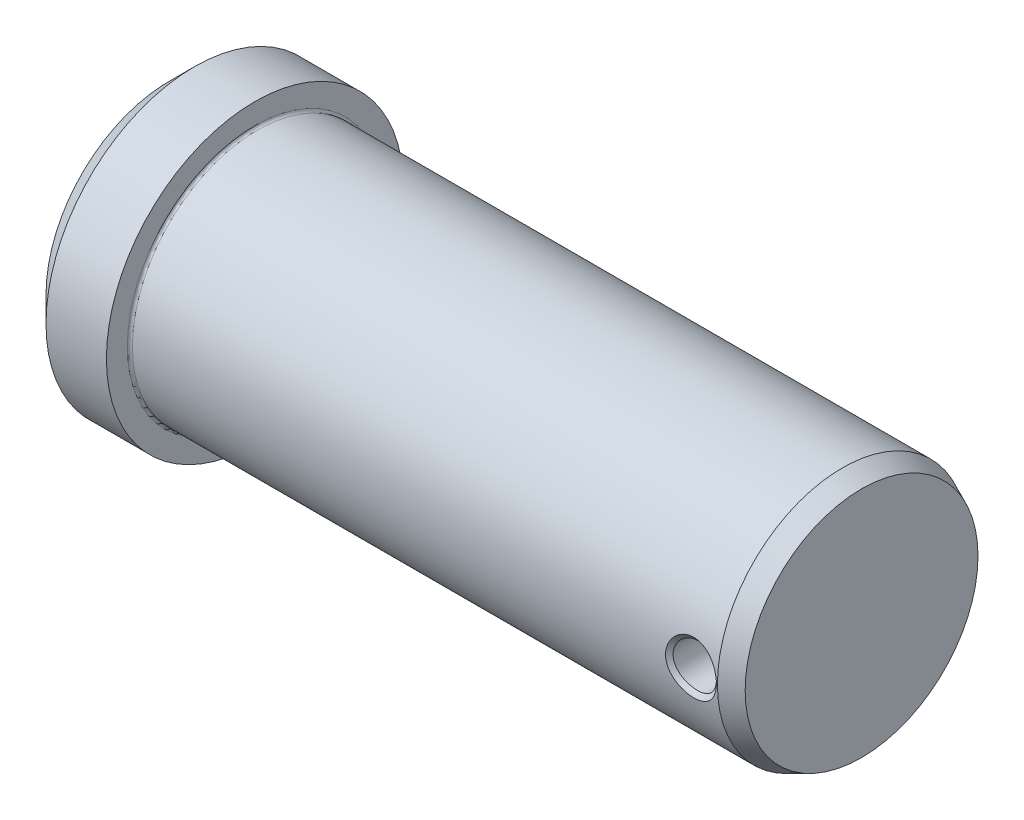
ISO-10303-21;
HEADER;
FILE_DESCRIPTION(('STEP AP214'),'2;1');
FILE_NAME('part.step','',(''),(''),'','','');
FILE_SCHEMA(('AUTOMOTIVE_DESIGN { 1 0 10303 214 1 1 1 1 }'));
ENDSEC;
DATA;
#1=APPLICATION_CONTEXT('core data for automotive mechanical design processes');
#2=APPLICATION_PROTOCOL_DEFINITION('international standard','automotive_design',2000,#1);
#3=PRODUCT_CONTEXT('',#1,'mechanical');
#4=PRODUCT('Part','Part','',(#3));
#5=PRODUCT_RELATED_PRODUCT_CATEGORY('part','',(#4));
#6=PRODUCT_DEFINITION_FORMATION('','',#4);
#7=PRODUCT_DEFINITION_CONTEXT('part definition',#1,'design');
#8=PRODUCT_DEFINITION('design','',#6,#7);
#9=PRODUCT_DEFINITION_SHAPE('','',#8);
#10=(LENGTH_UNIT() NAMED_UNIT(*) SI_UNIT(.MILLI.,.METRE.));
#11=(NAMED_UNIT(*) PLANE_ANGLE_UNIT() SI_UNIT($,.RADIAN.));
#12=(NAMED_UNIT(*) SI_UNIT($,.STERADIAN.) SOLID_ANGLE_UNIT());
#13=UNCERTAINTY_MEASURE_WITH_UNIT(LENGTH_MEASURE(1.E-05),#10,'distance_accuracy_value','');
#14=(GEOMETRIC_REPRESENTATION_CONTEXT(3) GLOBAL_UNCERTAINTY_ASSIGNED_CONTEXT((#13)) GLOBAL_UNIT_ASSIGNED_CONTEXT((#10,
#11,#12)) REPRESENTATION_CONTEXT('',''));
#15=CARTESIAN_POINT('',(0.,0.,0.));
#16=DIRECTION('',(0.,0.,1.));
#17=DIRECTION('',(1.,0.,0.));
#18=AXIS2_PLACEMENT_3D('',#15,#16,#17);
#19=CARTESIAN_POINT('',(0.,0.,0.));
#20=DIRECTION('',(-1.,0.,0.));
#21=DIRECTION('',(0.,0.,1.));
#22=AXIS2_PLACEMENT_3D('',#19,#20,#21);
#23=PLANE('',#22);
#24=CARTESIAN_POINT('',(0.,0.,0.));
#25=DIRECTION('',(-1.,0.,0.));
#26=DIRECTION('',(0.,0.,1.));
#27=AXIS2_PLACEMENT_3D('',#24,#25,#26);
#28=CIRCLE('',#27,12.446);
#29=CARTESIAN_POINT('',(0.,0.,12.446));
#30=VERTEX_POINT('',#29);
#31=EDGE_CURVE('E64',#30,#30,#28,.T.);
#32=ORIENTED_EDGE('',*,*,#31,.T.);
#33=EDGE_LOOP('',(#32));
#34=FACE_BOUND('',#33,.T.);
#35=ADVANCED_FACE('F37',(#34),#23,.T.);
#36=CARTESIAN_POINT('',(0.,0.,0.));
#37=DIRECTION('',(1.,0.,0.));
#38=DIRECTION('',(0.,0.,-1.));
#39=AXIS2_PLACEMENT_3D('',#36,#37,#38);
#40=CONICAL_SURFACE('',#39,12.446,0.785398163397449);
#41=CARTESIAN_POINT('',(2.54,0.,0.));
#42=DIRECTION('',(-1.,0.,0.));
#43=DIRECTION('',(0.,0.,1.));
#44=AXIS2_PLACEMENT_3D('',#41,#42,#43);
#45=CIRCLE('',#44,14.986);
#46=CARTESIAN_POINT('',(2.54,0.,14.986));
#47=VERTEX_POINT('',#46);
#48=EDGE_CURVE('E69',#47,#47,#45,.T.);
#49=ORIENTED_EDGE('',*,*,#48,.T.);
#50=EDGE_LOOP('',(#49));
#51=FACE_BOUND('',#50,.T.);
#52=ORIENTED_EDGE('',*,*,#31,.F.);
#53=EDGE_LOOP('',(#52));
#54=FACE_BOUND('',#53,.T.);
#55=ADVANCED_FACE('F162',(#51,#54),#40,.T.);
#56=CARTESIAN_POINT('',(0.,0.,0.));
#57=DIRECTION('',(-1.,0.,0.));
#58=DIRECTION('',(0.,0.,1.));
#59=AXIS2_PLACEMENT_3D('',#56,#57,#58);
#60=CYLINDRICAL_SURFACE('',#59,14.986);
#61=CARTESIAN_POINT('',(8.636,0.,0.));
#62=DIRECTION('',(-1.,0.,0.));
#63=DIRECTION('',(0.,0.,1.));
#64=AXIS2_PLACEMENT_3D('',#61,#62,#63);
#65=CIRCLE('',#64,14.986);
#66=CARTESIAN_POINT('',(8.636,0.,14.986));
#67=VERTEX_POINT('',#66);
#68=EDGE_CURVE('E74',#67,#67,#65,.T.);
#69=ORIENTED_EDGE('',*,*,#68,.T.);
#70=EDGE_LOOP('',(#69));
#71=FACE_BOUND('',#70,.T.);
#72=ORIENTED_EDGE('',*,*,#48,.F.);
#73=EDGE_LOOP('',(#72));
#74=FACE_BOUND('',#73,.T.);
#75=ADVANCED_FACE('F165',(#71,#74),#60,.T.);
#76=CARTESIAN_POINT('',(8.636,14.986,0.));
#77=DIRECTION('',(1.,0.,0.));
#78=DIRECTION('',(0.,0.,-1.));
#79=AXIS2_PLACEMENT_3D('',#76,#77,#78);
#80=PLANE('',#79);
#81=CARTESIAN_POINT('',(8.636,0.,0.));
#82=DIRECTION('',(-1.,0.,0.));
#83=DIRECTION('',(0.,0.,1.));
#84=AXIS2_PLACEMENT_3D('',#81,#82,#83);
#85=CIRCLE('',#84,12.87145);
#86=CARTESIAN_POINT('',(8.636,0.,12.87145));
#87=VERTEX_POINT('',#86);
#88=EDGE_CURVE('E179',#87,#87,#85,.T.);
#89=ORIENTED_EDGE('',*,*,#88,.T.);
#90=EDGE_LOOP('',(#89));
#91=FACE_BOUND('',#90,.T.);
#92=ORIENTED_EDGE('',*,*,#68,.F.);
#93=EDGE_LOOP('',(#92));
#94=FACE_BOUND('',#93,.T.);
#95=ADVANCED_FACE('F168',(#91,#94),#80,.T.);
#96=CARTESIAN_POINT('',(8.89,0.,0.));
#97=DIRECTION('',(-1.,0.,0.));
#98=DIRECTION('',(0.,0.,1.));
#99=AXIS2_PLACEMENT_3D('',#96,#97,#98);
#100=TOROIDAL_SURFACE('',#99,12.87145,0.254000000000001);
#101=ORIENTED_EDGE('',*,*,#88,.F.);
#102=EDGE_LOOP('',(#101));
#103=FACE_BOUND('',#102,.T.);
#104=CARTESIAN_POINT('',(8.89,0.,0.));
#105=DIRECTION('',(-1.,0.,0.));
#106=DIRECTION('',(0.,0.,1.));
#107=AXIS2_PLACEMENT_3D('',#104,#105,#106);
#108=CIRCLE('',#107,12.61745);
#109=CARTESIAN_POINT('',(8.89,0.,12.61745));
#110=VERTEX_POINT('',#109);
#111=EDGE_CURVE('E182',#110,#110,#108,.T.);
#112=ORIENTED_EDGE('',*,*,#111,.T.);
#113=EDGE_LOOP('',(#112));
#114=FACE_BOUND('',#113,.T.);
#115=ADVANCED_FACE('F120',(#103,#114),#100,.F.);
#116=CARTESIAN_POINT('',(0.,0.,0.));
#117=DIRECTION('',(-1.,0.,0.));
#118=DIRECTION('',(0.,0.,1.));
#119=AXIS2_PLACEMENT_3D('',#116,#117,#118);
#120=CYLINDRICAL_SURFACE('',#119,12.61745);
#121=CARTESIAN_POINT('',(67.8179999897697,0.,12.61745));
#122=CARTESIAN_POINT('',(67.8178069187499,0.696221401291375,12.6174155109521));
#123=CARTESIAN_POINT('',(67.5397729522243,1.3818841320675,12.5526092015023));
#124=CARTESIAN_POINT('',(66.5931709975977,2.35939139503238,12.403412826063));
#125=CARTESIAN_POINT('',(65.9281515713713,2.64550020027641,12.337009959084));
#126=CARTESIAN_POINT('',(64.5791761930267,2.64505437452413,12.3370697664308));
#127=CARTESIAN_POINT('',(63.9138142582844,2.36021994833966,12.4032851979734));
#128=CARTESIAN_POINT('',(62.9650043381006,1.38245980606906,12.5525262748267));
#129=CARTESIAN_POINT('',(62.687329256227,0.698953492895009,12.6174319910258));
#130=CARTESIAN_POINT('',(62.687070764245,-0.698964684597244,12.6174680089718));
#131=CARTESIAN_POINT('',(62.9644356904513,-1.38174711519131,12.5526236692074));
#132=CARTESIAN_POINT('',(63.9131331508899,-2.35964469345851,12.4033809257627));
#133=CARTESIAN_POINT('',(64.5793583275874,-2.64515652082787,12.3370415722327));
#134=CARTESIAN_POINT('',(65.9289069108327,-2.64539756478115,12.3370382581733));
#135=CARTESIAN_POINT('',(66.5929810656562,-2.35921376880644,12.4034030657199));
#136=CARTESIAN_POINT('',(67.5397237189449,-1.3823083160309,12.5525819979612));
#137=CARTESIAN_POINT('',(67.8181930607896,-0.696221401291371,12.6174844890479));
#138=CARTESIAN_POINT('',(67.8179999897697,0.,12.61745));
#139=B_SPLINE_CURVE_WITH_KNOTS('',3,(#121,#122,#123,#124,#125,#126,#127,#128,#129,#130,#131,
#132,#133,#134,#135,#136,#137,#138),.UNSPECIFIED.,.T.,.F.,(4,2,2,2,2,2,2,2,4),
(-0.0160717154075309,-0.0140609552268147,-0.0120501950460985,-0.0100394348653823,
-0.00802867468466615,-0.00601791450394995,-0.00400715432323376,-0.00199639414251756,
1.4366038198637E-05),.UNSPECIFIED.);
#140=CARTESIAN_POINT('',(67.8179999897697,0.,12.61745));
#141=VERTEX_POINT('',#140);
#142=EDGE_CURVE('E10',#141,#141,#139,.F.);
#143=ORIENTED_EDGE('',*,*,#142,.T.);
#144=EDGE_LOOP('',(#143));
#145=FACE_BOUND('',#144,.T.);
#146=CARTESIAN_POINT('',(67.8179999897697,0.,-12.61745));
#147=CARTESIAN_POINT('',(67.8178069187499,-0.696221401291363,-12.6174155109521));
#148=CARTESIAN_POINT('',(67.5397729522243,-1.38188413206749,-12.5526092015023));
#149=CARTESIAN_POINT('',(66.5931709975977,-2.35939139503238,-12.403412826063));
#150=CARTESIAN_POINT('',(65.9281515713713,-2.64550020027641,-12.337009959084));
#151=CARTESIAN_POINT('',(64.5791761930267,-2.64505437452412,-12.3370697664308));
#152=CARTESIAN_POINT('',(63.9138142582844,-2.36021994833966,-12.4032851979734));
#153=CARTESIAN_POINT('',(62.9650043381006,-1.38245980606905,-12.5525262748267));
#154=CARTESIAN_POINT('',(62.687329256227,-0.698953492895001,-12.6174319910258));
#155=CARTESIAN_POINT('',(62.687070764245,0.698964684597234,-12.6174680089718));
#156=CARTESIAN_POINT('',(62.9644356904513,1.38174711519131,-12.5526236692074));
#157=CARTESIAN_POINT('',(63.9131331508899,2.3596446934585,-12.4033809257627));
#158=CARTESIAN_POINT('',(64.5793583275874,2.64515652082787,-12.3370415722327));
#159=CARTESIAN_POINT('',(65.9289069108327,2.64539756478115,-12.3370382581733));
#160=CARTESIAN_POINT('',(66.5929810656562,2.35921376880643,-12.4034030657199));
#161=CARTESIAN_POINT('',(67.5397237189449,1.3823083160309,-12.5525819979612));
#162=CARTESIAN_POINT('',(67.8181930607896,0.696221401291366,-12.6174844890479));
#163=CARTESIAN_POINT('',(67.8179999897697,0.,-12.61745));
#164=B_SPLINE_CURVE_WITH_KNOTS('',3,(#146,#147,#148,#149,#150,#151,#152,#153,#154,#155,#156,
#157,#158,#159,#160,#161,#162,#163),.UNSPECIFIED.,.T.,.F.,(4,2,2,2,2,2,2,2,4),
(-0.0160717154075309,-0.0140609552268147,-0.0120501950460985,-0.0100394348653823,
-0.00802867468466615,-0.00601791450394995,-0.00400715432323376,-0.00199639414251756,
1.4366038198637E-05),.UNSPECIFIED.);
#165=CARTESIAN_POINT('',(67.8179999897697,0.,-12.61745));
#166=VERTEX_POINT('',#165);
#167=EDGE_CURVE('E54',#166,#166,#164,.F.);
#168=ORIENTED_EDGE('',*,*,#167,.T.);
#169=EDGE_LOOP('',(#168));
#170=FACE_BOUND('',#169,.T.);
#171=CARTESIAN_POINT('',(67.9196,0.,0.));
#172=DIRECTION('',(-1.,0.,0.));
#173=DIRECTION('',(0.,0.,1.));
#174=AXIS2_PLACEMENT_3D('',#171,#172,#173);
#175=CIRCLE('',#174,12.61745);
#176=CARTESIAN_POINT('',(67.9196,0.,12.61745));
#177=VERTEX_POINT('',#176);
#178=EDGE_CURVE('E187',#177,#177,#175,.T.);
#179=ORIENTED_EDGE('',*,*,#178,.T.);
#180=EDGE_LOOP('',(#179));
#181=FACE_BOUND('',#180,.T.);
#182=ORIENTED_EDGE('',*,*,#111,.F.);
#183=EDGE_LOOP('',(#182));
#184=FACE_BOUND('',#183,.T.);
#185=ADVANCED_FACE('F110',(#145,#170,#181,#184),#120,.T.);
#186=CARTESIAN_POINT('',(67.9196,0.,0.));
#187=DIRECTION('',(-1.,0.,0.));
#188=DIRECTION('',(0.,0.,1.));
#189=AXIS2_PLACEMENT_3D('',#186,#187,#188);
#190=CONICAL_SURFACE('',#189,12.61745,0.423400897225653);
#191=CARTESIAN_POINT('',(69.85,0.,0.));
#192=DIRECTION('',(-1.,0.,0.));
#193=DIRECTION('',(0.,0.,1.));
#194=AXIS2_PLACEMENT_3D('',#191,#192,#193);
#195=CIRCLE('',#194,11.7475);
#196=CARTESIAN_POINT('',(69.85,0.,11.7475));
#197=VERTEX_POINT('',#196);
#198=EDGE_CURVE('E190',#197,#197,#195,.T.);
#199=ORIENTED_EDGE('',*,*,#198,.T.);
#200=EDGE_LOOP('',(#199));
#201=FACE_BOUND('',#200,.T.);
#202=ORIENTED_EDGE('',*,*,#178,.F.);
#203=EDGE_LOOP('',(#202));
#204=FACE_BOUND('',#203,.T.);
#205=ADVANCED_FACE('F119',(#201,#204),#190,.T.);
#206=CARTESIAN_POINT('',(69.85,11.7475,0.));
#207=DIRECTION('',(1.,0.,0.));
#208=DIRECTION('',(0.,0.,-1.));
#209=AXIS2_PLACEMENT_3D('',#206,#207,#208);
#210=PLANE('',#209);
#211=ORIENTED_EDGE('',*,*,#198,.F.);
#212=EDGE_LOOP('',(#211));
#213=FACE_BOUND('',#212,.T.);
#214=ADVANCED_FACE('F92',(#213),#210,.T.);
#215=CARTESIAN_POINT('',(65.2526,0.,-12.61745));
#216=DIRECTION('',(0.,0.,1.));
#217=DIRECTION('',(1.,0.,0.));
#218=AXIS2_PLACEMENT_3D('',#215,#216,#217);
#219=CYLINDRICAL_SURFACE('',#218,2.1844);
#220=CARTESIAN_POINT('',(67.437,0.,12.2364500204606));
#221=CARTESIAN_POINT('',(67.4370110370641,-0.035904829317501,12.2364523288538));
#222=CARTESIAN_POINT('',(67.4360951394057,-0.0718081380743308,12.2362085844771));
#223=CARTESIAN_POINT('',(67.4324423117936,-0.143473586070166,12.2352547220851));
#224=CARTESIAN_POINT('',(67.429707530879,-0.179235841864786,12.23454515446));
#225=CARTESIAN_POINT('',(67.4224520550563,-0.250542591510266,12.2326858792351));
#226=CARTESIAN_POINT('',(67.4179325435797,-0.286087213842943,12.2315364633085));
#227=CARTESIAN_POINT('',(67.4071435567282,-0.356883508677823,12.2288239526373));
#228=CARTESIAN_POINT('',(67.400874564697,-0.392135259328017,12.2272609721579));
#229=CARTESIAN_POINT('',(67.386621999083,-0.462270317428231,12.2237476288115));
#230=CARTESIAN_POINT('',(67.3786384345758,-0.497153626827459,12.2217972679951));
#231=CARTESIAN_POINT('',(67.3609919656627,-0.566476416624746,12.2175354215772));
#232=CARTESIAN_POINT('',(67.3513287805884,-0.600915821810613,12.2152238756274));
#233=CARTESIAN_POINT('',(67.3303581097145,-0.669275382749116,12.2102658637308));
#234=CARTESIAN_POINT('',(67.3190501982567,-0.703195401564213,12.2076193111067));
#235=CARTESIAN_POINT('',(67.2948249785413,-0.770440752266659,12.202017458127));
#236=CARTESIAN_POINT('',(67.2819072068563,-0.803765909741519,12.1990620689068));
#237=CARTESIAN_POINT('',(67.2544970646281,-0.869746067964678,12.1928686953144));
#238=CARTESIAN_POINT('',(67.2400042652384,-0.902400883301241,12.189630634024));
#239=CARTESIAN_POINT('',(67.2094787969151,-0.96696485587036,12.1828980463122));
#240=CARTESIAN_POINT('',(67.1934457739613,-0.998873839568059,12.1794034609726));
#241=CARTESIAN_POINT('',(67.1598745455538,-1.06187062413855,12.1721839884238));
#242=CARTESIAN_POINT('',(67.1423360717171,-1.09295827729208,12.1684590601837));
#243=CARTESIAN_POINT('',(67.105788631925,-1.15423684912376,12.1608049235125));
#244=CARTESIAN_POINT('',(67.0867794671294,-1.18442764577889,12.1568756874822));
#245=CARTESIAN_POINT('',(67.0473253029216,-1.24383699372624,12.1488394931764));
#246=CARTESIAN_POINT('',(67.026880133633,-1.27305542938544,12.1447325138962));
#247=CARTESIAN_POINT('',(66.9845888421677,-1.33044440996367,12.1363654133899));
#248=CARTESIAN_POINT('',(66.9627425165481,-1.35861480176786,12.1321052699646));
#249=CARTESIAN_POINT('',(66.9176831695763,-1.4138326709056,12.1234638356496));
#250=CARTESIAN_POINT('',(66.8944698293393,-1.44087988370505,12.1190825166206));
#251=CARTESIAN_POINT('',(66.846713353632,-1.49377429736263,12.1102030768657));
#252=CARTESIAN_POINT('',(66.8221696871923,-1.51962101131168,12.1057049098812));
#253=CARTESIAN_POINT('',(66.7718002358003,-1.57002521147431,12.0967030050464));
#254=CARTESIAN_POINT('',(66.7459746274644,-1.59458287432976,12.0921992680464));
#255=CARTESIAN_POINT('',(66.6931274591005,-1.6423592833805,12.0832989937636));
#256=CARTESIAN_POINT('',(66.6661066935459,-1.66557889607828,12.0789023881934));
#257=CARTESIAN_POINT('',(66.6109463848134,-1.71064403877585,12.0702220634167));
#258=CARTESIAN_POINT('',(66.5828073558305,-1.73249018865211,12.0659382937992));
#259=CARTESIAN_POINT('',(66.5254849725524,-1.77477526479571,12.057516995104));
#260=CARTESIAN_POINT('',(66.4963019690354,-1.79521465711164,12.053379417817));
#261=CARTESIAN_POINT('',(66.4369666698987,-1.83465240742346,12.04527645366));
#262=CARTESIAN_POINT('',(66.4068146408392,-1.8536511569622,12.0413110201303));
#263=CARTESIAN_POINT('',(66.3456160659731,-1.89017388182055,12.0335802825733));
#264=CARTESIAN_POINT('',(66.3145697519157,-1.90769823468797,12.0298149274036));
#265=CARTESIAN_POINT('',(66.2516573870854,-1.94123832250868,12.0225117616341));
#266=CARTESIAN_POINT('',(66.2197915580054,-1.95725446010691,12.0189738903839));
#267=CARTESIAN_POINT('',(66.155314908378,-1.98774424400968,12.0121532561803));
#268=CARTESIAN_POINT('',(66.1227043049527,-2.0022183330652,12.0088704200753));
#269=CARTESIAN_POINT('',(66.0568128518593,-2.02959012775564,12.002587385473));
#270=CARTESIAN_POINT('',(66.023532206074,-2.04248830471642,11.9995871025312));
#271=CARTESIAN_POINT('',(65.9563754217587,-2.0666743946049,11.9938967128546));
#272=CARTESIAN_POINT('',(65.9224994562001,-2.07796276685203,11.9912065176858));
#273=CARTESIAN_POINT('',(65.8542268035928,-2.09889540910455,11.9861638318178));
#274=CARTESIAN_POINT('',(65.8198302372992,-2.1085400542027,11.9838112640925));
#275=CARTESIAN_POINT('',(65.7505911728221,-2.12615147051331,11.9794713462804));
#276=CARTESIAN_POINT('',(65.7157487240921,-2.13411842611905,11.9774839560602));
#277=CARTESIAN_POINT('',(65.6456927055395,-2.14834082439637,11.9739018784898));
#278=CARTESIAN_POINT('',(65.6104791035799,-2.15459611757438,11.9723072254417));
#279=CARTESIAN_POINT('',(65.5397555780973,-2.16536160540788,11.9695380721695));
#280=CARTESIAN_POINT('',(65.5042455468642,-2.169871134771,11.9683637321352));
#281=CARTESIAN_POINT('',(65.4330040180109,-2.17711203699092,11.9664625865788));
#282=CARTESIAN_POINT('',(65.3972723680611,-2.1798420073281,11.9657361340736));
#283=CARTESIAN_POINT('',(65.32566217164,-2.18348967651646,11.9647581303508));
#284=CARTESIAN_POINT('',(65.2897834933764,-2.18440497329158,11.9645072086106));
#285=CARTESIAN_POINT('',(65.2180193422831,-2.18439424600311,11.9645073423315));
#286=CARTESIAN_POINT('',(65.1821338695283,-2.18346785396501,11.9647584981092));
#287=CARTESIAN_POINT('',(65.1104971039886,-2.17980536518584,11.96573653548));
#288=CARTESIAN_POINT('',(65.0747457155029,-2.1770710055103,11.9664629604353));
#289=CARTESIAN_POINT('',(65.003453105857,-2.16982573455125,11.968363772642));
#290=CARTESIAN_POINT('',(64.9679117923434,-2.16531567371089,11.9695379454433));
#291=CARTESIAN_POINT('',(64.897115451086,-2.15455312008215,11.9723065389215));
#292=CARTESIAN_POINT('',(64.8618603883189,-2.14830084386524,11.9739009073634));
#293=CARTESIAN_POINT('',(64.7917125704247,-2.13408739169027,11.9774822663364));
#294=CARTESIAN_POINT('',(64.756819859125,-2.12612601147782,11.9794693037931));
#295=CARTESIAN_POINT('',(64.6874727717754,-2.1085277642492,11.9838084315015));
#296=CARTESIAN_POINT('',(64.6530185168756,-2.09889044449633,11.9861606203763));
#297=CARTESIAN_POINT('',(64.5846243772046,-2.07797353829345,11.9912025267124));
#298=CARTESIAN_POINT('',(64.550684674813,-2.06669338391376,11.9938923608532));
#299=CARTESIAN_POINT('',(64.4833957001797,-2.04252390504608,11.9995820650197));
#300=CARTESIAN_POINT('',(64.4500466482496,-2.02963399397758,12.0025820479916));
#301=CARTESIAN_POINT('',(64.3840150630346,-2.00227800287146,12.0088645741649));
#302=CARTESIAN_POINT('',(64.3513327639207,-1.98781138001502,12.0121472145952));
#303=CARTESIAN_POINT('',(64.2867108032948,-1.95733490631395,12.0189676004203));
#304=CARTESIAN_POINT('',(64.2547713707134,-1.94132458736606,12.0225054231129));
#305=CARTESIAN_POINT('',(64.1917112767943,-1.90779363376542,12.0298086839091));
#306=CARTESIAN_POINT('',(64.1605908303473,-1.89027260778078,12.0335741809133));
#307=CARTESIAN_POINT('',(64.0992448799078,-1.85375314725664,12.0413054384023));
#308=CARTESIAN_POINT('',(64.069019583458,-1.83475437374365,12.0452712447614));
#309=CARTESIAN_POINT('',(64.0095399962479,-1.79531236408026,12.0533752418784));
#310=CARTESIAN_POINT('',(63.9802859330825,-1.77486879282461,12.0575134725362));
#311=CARTESIAN_POINT('',(63.9228252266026,-1.73257012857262,12.0659363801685));
#312=CARTESIAN_POINT('',(63.8946188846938,-1.71071463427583,12.0702210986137));
#313=CARTESIAN_POINT('',(63.839328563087,-1.66562533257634,12.078903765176));
#314=CARTESIAN_POINT('',(63.8122450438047,-1.64239096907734,12.0833017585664));
#315=CARTESIAN_POINT('',(63.7592805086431,-1.59457648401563,12.0922049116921));
#316=CARTESIAN_POINT('',(63.733400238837,-1.56999554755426,12.0967101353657));
#317=CARTESIAN_POINT('',(63.682932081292,-1.51955294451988,12.1057149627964));
#318=CARTESIAN_POINT('',(63.6583438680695,-1.49369160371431,12.1102145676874));
#319=CARTESIAN_POINT('',(63.6105099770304,-1.44078923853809,12.1190965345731));
#320=CARTESIAN_POINT('',(63.5872628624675,-1.41374953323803,12.1234790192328));
#321=CARTESIAN_POINT('',(63.542148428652,-1.35856197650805,12.132122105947));
#322=CARTESIAN_POINT('',(63.5202799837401,-1.33041506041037,12.136382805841));
#323=CARTESIAN_POINT('',(63.4779548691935,-1.27308511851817,12.1447505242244));
#324=CARTESIAN_POINT('',(63.4574973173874,-1.24390275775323,12.1488576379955));
#325=CARTESIAN_POINT('',(63.4180274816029,-1.18457368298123,12.1568936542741));
#326=CARTESIAN_POINT('',(63.3990144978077,-1.15442744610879,12.1608226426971));
#327=CARTESIAN_POINT('',(63.3624669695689,-1.09324234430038,12.1684759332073));
#328=CARTESIAN_POINT('',(63.344931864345,-1.0622038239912,12.1722003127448));
#329=CARTESIAN_POINT('',(63.3113734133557,-0.999305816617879,12.1794184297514));
#330=CARTESIAN_POINT('',(63.2953496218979,-0.96744657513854,12.1829122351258));
#331=CARTESIAN_POINT('',(63.2648471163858,-0.902978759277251,12.1896431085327));
#332=CARTESIAN_POINT('',(63.2503680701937,-0.870370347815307,12.1928802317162));
#333=CARTESIAN_POINT('',(63.2229883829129,-0.804475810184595,12.1990716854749));
#334=CARTESIAN_POINT('',(63.210087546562,-0.771189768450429,12.2020260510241));
#335=CARTESIAN_POINT('',(63.1858975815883,-0.704011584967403,12.2076259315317));
#336=CARTESIAN_POINT('',(63.1746084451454,-0.670119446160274,12.2102714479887));
#337=CARTESIAN_POINT('',(63.1536751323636,-0.60180068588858,12.2152275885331));
#338=CARTESIAN_POINT('',(63.1440312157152,-0.567373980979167,12.2175381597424));
#339=CARTESIAN_POINT('',(63.1264215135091,-0.498057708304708,12.2217983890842));
#340=CARTESIAN_POINT('',(63.1184563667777,-0.4631679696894,12.2237479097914));
#341=CARTESIAN_POINT('',(63.1042372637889,-0.392997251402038,12.2272600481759));
#342=CARTESIAN_POINT('',(63.0979844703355,-0.357716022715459,12.2288224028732));
#343=CARTESIAN_POINT('',(63.0872229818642,-0.286833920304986,12.2315342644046));
#344=CARTESIAN_POINT('',(63.082716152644,-0.251232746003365,12.2326833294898));
#345=CARTESIAN_POINT('',(63.0754793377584,-0.179782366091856,12.2345427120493));
#346=CARTESIAN_POINT('',(63.0727521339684,-0.143932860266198,12.2352523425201));
#347=CARTESIAN_POINT('',(63.0691070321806,-0.0720571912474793,12.2362070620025));
#348=CARTESIAN_POINT('',(63.0681930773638,-0.0360308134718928,12.2364511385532));
#349=CARTESIAN_POINT('',(63.068206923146,0.0360241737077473,12.2364489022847));
#350=CARTESIAN_POINT('',(63.0691348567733,0.0720527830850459,12.2362025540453));
#351=CARTESIAN_POINT('',(63.0728079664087,0.143936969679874,12.2352431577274));
#352=CARTESIAN_POINT('',(63.0755494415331,0.179792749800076,12.2345310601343));
#353=CARTESIAN_POINT('',(63.0828146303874,0.251259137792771,12.2326667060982));
#354=CARTESIAN_POINT('',(63.0873357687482,0.286870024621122,12.2315150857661));
#355=CARTESIAN_POINT('',(63.0981256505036,0.357774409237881,12.2287980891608));
#356=CARTESIAN_POINT('',(63.1043926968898,0.393068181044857,12.2272331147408));
#357=CARTESIAN_POINT('',(63.1186399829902,0.463266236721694,12.2237157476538));
#358=CARTESIAN_POINT('',(63.1266191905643,0.498170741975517,12.2217635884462));
#359=CARTESIAN_POINT('',(63.1442566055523,0.567518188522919,12.2174981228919));
#360=CARTESIAN_POINT('',(63.1539142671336,0.601961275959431,12.2151849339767));
#361=CARTESIAN_POINT('',(63.1748745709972,0.670313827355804,12.2102236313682));
#362=CARTESIAN_POINT('',(63.1861770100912,0.704223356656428,12.2075755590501));
#363=CARTESIAN_POINT('',(63.2103929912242,0.771436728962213,12.2019706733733));
#364=CARTESIAN_POINT('',(63.2233065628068,0.80474056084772,12.1990138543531));
#365=CARTESIAN_POINT('',(63.2507110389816,0.870670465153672,12.1928176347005));
#366=CARTESIAN_POINT('',(63.2652021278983,0.903296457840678,12.1895782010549));
#367=CARTESIAN_POINT('',(63.2957279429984,0.967798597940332,12.1828428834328));
#368=CARTESIAN_POINT('',(63.3117629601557,0.99967460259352,12.1793469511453));
#369=CARTESIAN_POINT('',(63.3453429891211,1.06260467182,12.1721247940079));
#370=CARTESIAN_POINT('',(63.3628883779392,1.09365852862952,12.1683985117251));
#371=CARTESIAN_POINT('',(63.3994555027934,1.15487220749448,12.160741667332));
#372=CARTESIAN_POINT('',(63.4184777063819,1.18503174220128,12.1568110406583));
#373=CARTESIAN_POINT('',(63.4579648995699,1.24438469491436,12.1487720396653));
#374=CARTESIAN_POINT('',(63.4784304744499,1.27357771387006,12.1446635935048));
#375=CARTESIAN_POINT('',(63.5207704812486,1.33092558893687,12.1362935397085));
#376=CARTESIAN_POINT('',(63.5426456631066,1.35907987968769,12.1320318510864));
#377=CARTESIAN_POINT('',(63.5877721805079,1.41427829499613,12.1233871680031));
#378=CARTESIAN_POINT('',(63.6110244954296,1.44132160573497,12.1190040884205));
#379=CARTESIAN_POINT('',(63.6588677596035,1.49422619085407,12.1101213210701));
#380=CARTESIAN_POINT('',(63.6834599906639,1.52008628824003,12.1056215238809));
#381=CARTESIAN_POINT('',(63.7339325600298,1.57052183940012,12.0966169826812));
#382=CARTESIAN_POINT('',(63.7598130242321,1.59509716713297,12.0921122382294));
#383=CARTESIAN_POINT('',(63.8127723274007,1.64289720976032,12.0832108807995));
#384=CARTESIAN_POINT('',(63.839850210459,1.66612296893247,12.0788141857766));
#385=CARTESIAN_POINT('',(63.8951246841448,1.71119193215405,12.0701347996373));
#386=CARTESIAN_POINT('',(63.9233206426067,1.73303589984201,12.0658520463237));
#387=CARTESIAN_POINT('',(63.9807564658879,1.77530909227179,12.0574336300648));
#388=CARTESIAN_POINT('',(64.0099958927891,1.79573890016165,12.0532979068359));
#389=CARTESIAN_POINT('',(64.0694427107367,1.83515151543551,12.0451993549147));
#390=CARTESIAN_POINT('',(64.0996497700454,1.85413481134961,12.0412364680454));
#391=CARTESIAN_POINT('',(64.1609563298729,1.89062204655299,12.0335113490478));
#392=CARTESIAN_POINT('',(64.1920555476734,1.90812644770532,12.0297490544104));
#393=CARTESIAN_POINT('',(64.2550708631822,1.94162346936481,12.0224523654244));
#394=CARTESIAN_POINT('',(64.2869866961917,1.95761657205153,12.0189178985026));
#395=CARTESIAN_POINT('',(64.3515597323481,1.98805852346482,12.0121042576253));
#396=CARTESIAN_POINT('',(64.3842166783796,2.00250789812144,12.0088249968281));
#397=CARTESIAN_POINT('',(64.450196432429,2.02982989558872,12.0025491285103));
#398=CARTESIAN_POINT('',(64.4835189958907,2.04270308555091,11.9995524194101));
#399=CARTESIAN_POINT('',(64.5507544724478,2.06684021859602,11.9938690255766));
#400=CARTESIAN_POINT('',(64.5846671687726,2.07810473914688,11.99118222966));
#401=CARTESIAN_POINT('',(64.6530073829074,2.09899206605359,11.986146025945));
#402=CARTESIAN_POINT('',(64.6874347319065,2.10861539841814,11.9837965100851));
#403=CARTESIAN_POINT('',(64.7567287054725,2.12618795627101,11.9794622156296));
#404=CARTESIAN_POINT('',(64.7915952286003,2.13413756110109,11.9774773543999));
#405=CARTESIAN_POINT('',(64.8616919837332,2.14833032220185,11.9738997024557));
#406=CARTESIAN_POINT('',(64.896922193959,2.15457358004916,11.9723068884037));
#407=CARTESIAN_POINT('',(64.9676707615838,2.16532160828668,11.9695406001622));
#408=CARTESIAN_POINT('',(65.0031891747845,2.16982603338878,11.9683672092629));
#409=CARTESIAN_POINT('',(65.0744385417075,2.17706389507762,11.9664670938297));
#410=CARTESIAN_POINT('',(65.1101696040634,2.17979633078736,11.9657406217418));
#411=CARTESIAN_POINT('',(65.1817688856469,2.18346029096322,11.9647612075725));
#412=CARTESIAN_POINT('',(65.2176372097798,2.1843899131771,11.9645087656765));
#413=CARTESIAN_POINT('',(65.2893729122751,2.18440971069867,11.9645056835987));
#414=CARTESIAN_POINT('',(65.3252402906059,2.1834999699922,11.9647550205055));
#415=CARTESIAN_POINT('',(65.3968351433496,2.17986279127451,11.9657304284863));
#416=CARTESIAN_POINT('',(65.4325627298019,2.17713740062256,11.9664559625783));
#417=CARTESIAN_POINT('',(65.5038024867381,2.16990572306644,11.9683555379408));
#418=CARTESIAN_POINT('',(65.5393147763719,2.16540053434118,11.9695293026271));
#419=CARTESIAN_POINT('',(65.6100482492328,2.15464336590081,11.9722976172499));
#420=CARTESIAN_POINT('',(65.6452694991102,2.14839179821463,11.9738920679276));
#421=CARTESIAN_POINT('',(65.7153453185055,2.13417636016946,11.9774740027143));
#422=CARTESIAN_POINT('',(65.7501998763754,2.12621243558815,11.979461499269));
#423=CARTESIAN_POINT('',(65.8194667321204,2.10860638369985,11.9838018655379));
#424=CARTESIAN_POINT('',(65.8538789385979,2.09896391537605,11.9861548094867));
#425=CARTESIAN_POINT('',(65.9221855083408,2.0780347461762,11.9911984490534));
#426=CARTESIAN_POINT('',(65.9560797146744,2.06674755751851,11.9938892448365));
#427=CARTESIAN_POINT('',(66.0232746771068,2.04256276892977,11.9995810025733));
#428=CARTESIAN_POINT('',(66.0565752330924,2.02966463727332,12.002582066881));
#429=CARTESIAN_POINT('',(66.1225072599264,2.00229168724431,12.0088667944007));
#430=CARTESIAN_POINT('',(66.155138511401,1.98781636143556,12.0121505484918));
#431=CARTESIAN_POINT('',(66.2196562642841,1.95732268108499,12.0189731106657));
#432=CARTESIAN_POINT('',(66.2515425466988,1.94130387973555,12.0225119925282));
#433=CARTESIAN_POINT('',(66.3144946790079,1.90775687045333,12.0298172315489));
#434=CARTESIAN_POINT('',(66.3455603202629,1.8902282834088,12.0335836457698));
#435=CARTESIAN_POINT('',(66.4067954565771,1.85369532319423,12.0413165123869));
#436=CARTESIAN_POINT('',(66.436964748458,1.83469061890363,12.0452830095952));
#437=CARTESIAN_POINT('',(66.4963315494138,1.79523904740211,12.0533880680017));
#438=CARTESIAN_POINT('',(66.5255288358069,1.774791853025,12.0575266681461));
#439=CARTESIAN_POINT('',(66.5828757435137,1.73248903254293,12.0659499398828));
#440=CARTESIAN_POINT('',(66.6110250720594,1.71063301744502,12.0702346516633));
#441=CARTESIAN_POINT('',(66.6662012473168,1.6655461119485,12.0789167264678));
#442=CARTESIAN_POINT('',(66.6932276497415,1.64231468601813,12.0833141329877));
#443=CARTESIAN_POINT('',(66.7460794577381,1.59451149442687,12.0922158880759));
#444=CARTESIAN_POINT('',(66.7719041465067,1.56993894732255,12.0967202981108));
#445=CARTESIAN_POINT('',(66.8222671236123,1.51950597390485,12.1057230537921));
#446=CARTESIAN_POINT('',(66.8468053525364,1.49364548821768,12.1102213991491));
#447=CARTESIAN_POINT('',(66.8945496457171,1.44072834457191,12.1191004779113));
#448=CARTESIAN_POINT('',(66.9177563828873,1.41367230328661,12.1234812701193));
#449=CARTESIAN_POINT('',(66.9628007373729,1.35844020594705,12.132121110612));
#450=CARTESIAN_POINT('',(66.984638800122,1.33026451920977,12.1363801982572));
#451=CARTESIAN_POINT('',(67.0269125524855,1.27286819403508,12.1447447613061));
#452=CARTESIAN_POINT('',(67.0473485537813,1.24364779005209,12.1488502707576));
#453=CARTESIAN_POINT('',(67.0867838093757,1.18423724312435,12.1568832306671));
#454=CARTESIAN_POINT('',(67.1057833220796,1.15404727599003,12.1608107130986));
#455=CARTESIAN_POINT('',(67.1423114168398,1.0927726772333,12.1684611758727));
#456=CARTESIAN_POINT('',(67.1598402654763,1.06168820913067,12.1721841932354));
#457=CARTESIAN_POINT('',(67.1933927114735,0.998699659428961,12.1793998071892));
#458=CARTESIAN_POINT('',(67.2094166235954,0.966795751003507,12.1828924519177));
#459=CARTESIAN_POINT('',(67.239924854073,0.902243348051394,12.1896212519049));
#460=CARTESIAN_POINT('',(67.2544095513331,0.869595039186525,12.1928574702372));
#461=CARTESIAN_POINT('',(67.2818049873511,0.803628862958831,12.1990473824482));
#462=CARTESIAN_POINT('',(67.2947161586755,0.770311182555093,12.2020011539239));
#463=CARTESIAN_POINT('',(67.3189301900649,0.703081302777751,12.2076001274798));
#464=CARTESIAN_POINT('',(67.3302334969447,0.669169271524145,12.2102454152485));
#465=CARTESIAN_POINT('',(67.3511974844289,0.600825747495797,12.21520138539));
#466=CARTESIAN_POINT('',(67.3608585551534,0.566394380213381,12.2175121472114));
#467=CARTESIAN_POINT('',(67.378503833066,0.497087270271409,12.221773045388));
#468=CARTESIAN_POINT('',(67.3864882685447,0.462211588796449,12.2237232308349));
#469=CARTESIAN_POINT('',(67.4007461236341,0.392090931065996,12.2272369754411));
#470=CARTESIAN_POINT('',(67.4070194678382,0.35684593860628,12.228800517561));
#471=CARTESIAN_POINT('',(67.4178212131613,0.286061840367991,12.2315150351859));
#472=CARTESIAN_POINT('',(67.4223490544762,0.250522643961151,12.232665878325));
#473=CARTESIAN_POINT('',(67.4296257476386,0.179224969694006,12.2345290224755));
#474=CARTESIAN_POINT('',(67.4323733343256,0.143466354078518,12.2352410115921));
#475=CARTESIAN_POINT('',(67.4360568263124,0.0718059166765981,12.2362008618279));
#476=CARTESIAN_POINT('',(67.4369905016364,0.0359039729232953,12.2364481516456));
#477=CARTESIAN_POINT('',(67.437,0.,12.2364500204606));
#478=B_SPLINE_CURVE_WITH_KNOTS('',3,(#220,#221,#222,#223,#224,#225,#226,#227,#228,#229,#230,
#231,#232,#233,#234,#235,#236,#237,#238,#239,#240,#241,#242,#243,#244,#245,#246,#247,#248,#249,
#250,#251,#252,#253,#254,#255,#256,#257,#258,#259,#260,#261,#262,#263,#264,#265,#266,#267,#268,
#269,#270,#271,#272,#273,#274,#275,#276,#277,#278,#279,#280,#281,#282,#283,#284,#285,#286,#287,
#288,#289,#290,#291,#292,#293,#294,#295,#296,#297,#298,#299,#300,#301,#302,#303,#304,#305,#306,
#307,#308,#309,#310,#311,#312,#313,#314,#315,#316,#317,#318,#319,#320,#321,#322,#323,#324,#325,
#326,#327,#328,#329,#330,#331,#332,#333,#334,#335,#336,#337,#338,#339,#340,#341,#342,#343,#344,
#345,#346,#347,#348,#349,#350,#351,#352,#353,#354,#355,#356,#357,#358,#359,#360,#361,#362,#363,
#364,#365,#366,#367,#368,#369,#370,#371,#372,#373,#374,#375,#376,#377,#378,#379,#380,#381,#382,
#383,#384,#385,#386,#387,#388,#389,#390,#391,#392,#393,#394,#395,#396,#397,#398,#399,#400,#401,
#402,#403,#404,#405,#406,#407,#408,#409,#410,#411,#412,#413,#414,#415,#416,#417,#418,#419,#420,
#421,#422,#423,#424,#425,#426,#427,#428,#429,#430,#431,#432,#433,#434,#435,#436,#437,#438,#439,
#440,#441,#442,#443,#444,#445,#446,#447,#448,#449,#450,#451,#452,#453,#454,#455,#456,#457,#458,
#459,#460,#461,#462,#463,#464,#465,#466,#467,#468,#469,#470,#471,#472,#473,#474,#475,#476,#477),
.UNSPECIFIED.,.F.,.F.,(4,2,2,2,2,2,2,2,2,2,2,2,2,2,2,2,2,2,2,2,2,2,2,2,2,2,2,2,2,2,2,2,2,2,2,2,
2,2,2,2,2,2,2,2,2,2,2,2,2,2,2,2,2,2,2,2,2,2,2,2,2,2,2,2,2,2,2,2,2,2,2,2,2,2,2,2,2,2,2,2,2,2,2,2,
2,2,2,2,2,2,2,2,2,2,2,2,2,2,2,2,2,2,2,2,2,2,2,2,2,2,2,2,2,2,2,2,2,2,2,2,2,2,2,2,2,2,2,2,4),(0.,
0.107699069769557,0.215271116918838,0.322771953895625,0.430243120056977,0.537713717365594,
0.645202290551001,0.752718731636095,0.860266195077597,0.967843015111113,1.07544462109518,
1.18306544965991,1.29070085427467,1.39834901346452,1.50601283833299,1.61370187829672,
1.72143422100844,1.82915176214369,1.93679874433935,2.0443967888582,2.15195901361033,
2.25949189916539,2.36699716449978,2.47447364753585,2.58191918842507,2.68933251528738,
2.79671513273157,2.90407321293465,3.01141948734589,3.11877513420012,3.22617165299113,
3.3336527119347,3.44127594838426,3.5489206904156,3.65646215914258,3.76395218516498,
3.87142885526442,3.97891837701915,4.08643698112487,4.19399284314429,4.30158801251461,
4.40922034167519,4.51688541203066,4.62457845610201,4.73229627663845,4.84003916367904,
4.94781280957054,5.05563021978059,5.16351361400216,5.27136969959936,5.37910800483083,
5.48675717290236,5.59433841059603,5.70186719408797,5.80935499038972,5.91681098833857,
6.0242438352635,6.13166337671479,6.23908239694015,6.34651835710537,6.4539951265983,
6.56154470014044,6.66920888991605,6.77704097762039,6.88510730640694,6.99318144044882,
7.10103570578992,7.20873446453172,7.3163289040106,7.42385866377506,7.53135352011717,
7.63883510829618,7.7463186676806,7.85381479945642,7.96133123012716,8.06887457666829,
8.17645211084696,8.28407352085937,8.39175266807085,8.49950933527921,8.60737096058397,
8.71524314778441,8.82303072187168,8.93075819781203,9.03844098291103,9.14608723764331,
9.25369974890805,9.36127780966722,9.46881910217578,9.57632158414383,9.68378537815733,
9.79121466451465,9.8986195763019,10.0060180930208,10.113437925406,10.2209183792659,
10.3285121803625,10.4361010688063,10.5435688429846,10.6509704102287,10.7583466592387,
10.8657263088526,10.9731277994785,11.0805612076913,11.188030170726,11.2955338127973,
11.4030686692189,11.5106306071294,11.6182167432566,11.7258273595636,11.8334678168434,
11.9411504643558,12.0488965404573,12.156647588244,12.2643436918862,12.3720045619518,
12.4796414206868,12.5872588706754,12.6948567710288,12.8024321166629,12.9099809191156,
13.0175000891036,13.1249893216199,13.2324529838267,13.3399020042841,13.4473557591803,
13.5548439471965,13.6624084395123,13.770105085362),.UNSPECIFIED.);
#479=CARTESIAN_POINT('',(67.437,0.,12.2364500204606));
#480=VERTEX_POINT('',#479);
#481=EDGE_CURVE('E49',#480,#480,#478,.F.);
#482=ORIENTED_EDGE('',*,*,#481,.T.);
#483=EDGE_LOOP('',(#482));
#484=FACE_BOUND('',#483,.T.);
#485=CARTESIAN_POINT('',(67.437,0.,-12.2364500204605));
#486=CARTESIAN_POINT('',(67.4370110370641,0.0359048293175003,-12.2364523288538));
#487=CARTESIAN_POINT('',(67.4360951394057,0.0718081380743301,-12.2362085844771));
#488=CARTESIAN_POINT('',(67.4324423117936,0.143473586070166,-12.2352547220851));
#489=CARTESIAN_POINT('',(67.429707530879,0.179235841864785,-12.23454515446));
#490=CARTESIAN_POINT('',(67.4224520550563,0.250542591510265,-12.2326858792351));
#491=CARTESIAN_POINT('',(67.4179325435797,0.286087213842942,-12.2315364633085));
#492=CARTESIAN_POINT('',(67.4071435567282,0.356883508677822,-12.2288239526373));
#493=CARTESIAN_POINT('',(67.400874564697,0.392135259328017,-12.2272609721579));
#494=CARTESIAN_POINT('',(67.386621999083,0.46227031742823,-12.2237476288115));
#495=CARTESIAN_POINT('',(67.3786384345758,0.497153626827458,-12.2217972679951));
#496=CARTESIAN_POINT('',(67.3609919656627,0.566476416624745,-12.2175354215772));
#497=CARTESIAN_POINT('',(67.3513287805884,0.600915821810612,-12.2152238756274));
#498=CARTESIAN_POINT('',(67.3303581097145,0.669275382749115,-12.2102658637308));
#499=CARTESIAN_POINT('',(67.3190501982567,0.703195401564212,-12.2076193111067));
#500=CARTESIAN_POINT('',(67.2948249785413,0.770440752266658,-12.202017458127));
#501=CARTESIAN_POINT('',(67.2819072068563,0.803765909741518,-12.1990620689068));
#502=CARTESIAN_POINT('',(67.2544970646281,0.869746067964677,-12.1928686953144));
#503=CARTESIAN_POINT('',(67.2400042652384,0.90240088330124,-12.189630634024));
#504=CARTESIAN_POINT('',(67.2094787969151,0.966964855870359,-12.1828980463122));
#505=CARTESIAN_POINT('',(67.1934457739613,0.998873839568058,-12.1794034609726));
#506=CARTESIAN_POINT('',(67.1598745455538,1.06187062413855,-12.1721839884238));
#507=CARTESIAN_POINT('',(67.1423360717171,1.09295827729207,-12.1684590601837));
#508=CARTESIAN_POINT('',(67.105788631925,1.15423684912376,-12.1608049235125));
#509=CARTESIAN_POINT('',(67.0867794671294,1.18442764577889,-12.1568756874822));
#510=CARTESIAN_POINT('',(67.0473253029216,1.24383699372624,-12.1488394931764));
#511=CARTESIAN_POINT('',(67.026880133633,1.27305542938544,-12.1447325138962));
#512=CARTESIAN_POINT('',(66.9845888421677,1.33044440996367,-12.1363654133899));
#513=CARTESIAN_POINT('',(66.9627425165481,1.35861480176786,-12.1321052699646));
#514=CARTESIAN_POINT('',(66.9176831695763,1.4138326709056,-12.1234638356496));
#515=CARTESIAN_POINT('',(66.8944698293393,1.44087988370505,-12.1190825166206));
#516=CARTESIAN_POINT('',(66.846713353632,1.49377429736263,-12.1102030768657));
#517=CARTESIAN_POINT('',(66.8221696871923,1.51962101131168,-12.1057049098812));
#518=CARTESIAN_POINT('',(66.7718002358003,1.57002521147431,-12.0967030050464));
#519=CARTESIAN_POINT('',(66.7459746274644,1.59458287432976,-12.0921992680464));
#520=CARTESIAN_POINT('',(66.6931274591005,1.6423592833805,-12.0832989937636));
#521=CARTESIAN_POINT('',(66.6661066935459,1.66557889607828,-12.0789023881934));
#522=CARTESIAN_POINT('',(66.6109463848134,1.71064403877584,-12.0702220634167));
#523=CARTESIAN_POINT('',(66.5828073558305,1.73249018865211,-12.0659382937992));
#524=CARTESIAN_POINT('',(66.5254849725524,1.77477526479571,-12.057516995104));
#525=CARTESIAN_POINT('',(66.4963019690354,1.79521465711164,-12.053379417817));
#526=CARTESIAN_POINT('',(66.4369666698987,1.83465240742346,-12.04527645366));
#527=CARTESIAN_POINT('',(66.4068146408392,1.8536511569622,-12.0413110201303));
#528=CARTESIAN_POINT('',(66.3456160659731,1.89017388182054,-12.0335802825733));
#529=CARTESIAN_POINT('',(66.3145697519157,1.90769823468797,-12.0298149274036));
#530=CARTESIAN_POINT('',(66.2516573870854,1.94123832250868,-12.0225117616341));
#531=CARTESIAN_POINT('',(66.2197915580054,1.95725446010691,-12.0189738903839));
#532=CARTESIAN_POINT('',(66.155314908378,1.98774424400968,-12.0121532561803));
#533=CARTESIAN_POINT('',(66.1227043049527,2.0022183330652,-12.0088704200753));
#534=CARTESIAN_POINT('',(66.0568128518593,2.02959012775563,-12.002587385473));
#535=CARTESIAN_POINT('',(66.023532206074,2.04248830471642,-11.9995871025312));
#536=CARTESIAN_POINT('',(65.9563754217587,2.0666743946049,-11.9938967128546));
#537=CARTESIAN_POINT('',(65.9224994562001,2.07796276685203,-11.9912065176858));
#538=CARTESIAN_POINT('',(65.8542268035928,2.09889540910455,-11.9861638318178));
#539=CARTESIAN_POINT('',(65.8198302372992,2.10854005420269,-11.9838112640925));
#540=CARTESIAN_POINT('',(65.7505911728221,2.1261514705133,-11.9794713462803));
#541=CARTESIAN_POINT('',(65.7157487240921,2.13411842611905,-11.9774839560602));
#542=CARTESIAN_POINT('',(65.6456927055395,2.14834082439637,-11.9739018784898));
#543=CARTESIAN_POINT('',(65.6104791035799,2.15459611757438,-11.9723072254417));
#544=CARTESIAN_POINT('',(65.5397555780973,2.16536160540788,-11.9695380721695));
#545=CARTESIAN_POINT('',(65.5042455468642,2.169871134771,-11.9683637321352));
#546=CARTESIAN_POINT('',(65.4330040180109,2.17711203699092,-11.9664625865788));
#547=CARTESIAN_POINT('',(65.3972723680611,2.1798420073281,-11.9657361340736));
#548=CARTESIAN_POINT('',(65.32566217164,2.18348967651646,-11.9647581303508));
#549=CARTESIAN_POINT('',(65.2897834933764,2.18440497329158,-11.9645072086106));
#550=CARTESIAN_POINT('',(65.2180193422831,2.18439424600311,-11.9645073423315));
#551=CARTESIAN_POINT('',(65.1821338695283,2.183467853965,-11.9647584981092));
#552=CARTESIAN_POINT('',(65.1104971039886,2.17980536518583,-11.96573653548));
#553=CARTESIAN_POINT('',(65.0747457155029,2.1770710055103,-11.9664629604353));
#554=CARTESIAN_POINT('',(65.003453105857,2.16982573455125,-11.968363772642));
#555=CARTESIAN_POINT('',(64.9679117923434,2.16531567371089,-11.9695379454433));
#556=CARTESIAN_POINT('',(64.897115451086,2.15455312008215,-11.9723065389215));
#557=CARTESIAN_POINT('',(64.8618603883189,2.14830084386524,-11.9739009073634));
#558=CARTESIAN_POINT('',(64.7917125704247,2.13408739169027,-11.9774822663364));
#559=CARTESIAN_POINT('',(64.756819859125,2.12612601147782,-11.9794693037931));
#560=CARTESIAN_POINT('',(64.6874727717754,2.1085277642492,-11.9838084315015));
#561=CARTESIAN_POINT('',(64.6530185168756,2.09889044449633,-11.9861606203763));
#562=CARTESIAN_POINT('',(64.5846243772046,2.07797353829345,-11.9912025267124));
#563=CARTESIAN_POINT('',(64.550684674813,2.06669338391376,-11.9938923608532));
#564=CARTESIAN_POINT('',(64.4833957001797,2.04252390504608,-11.9995820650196));
#565=CARTESIAN_POINT('',(64.4500466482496,2.02963399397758,-12.0025820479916));
#566=CARTESIAN_POINT('',(64.3840150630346,2.00227800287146,-12.0088645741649));
#567=CARTESIAN_POINT('',(64.3513327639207,1.98781138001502,-12.0121472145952));
#568=CARTESIAN_POINT('',(64.2867108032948,1.95733490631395,-12.0189676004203));
#569=CARTESIAN_POINT('',(64.2547713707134,1.94132458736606,-12.0225054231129));
#570=CARTESIAN_POINT('',(64.1917112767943,1.90779363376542,-12.0298086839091));
#571=CARTESIAN_POINT('',(64.1605908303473,1.89027260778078,-12.0335741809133));
#572=CARTESIAN_POINT('',(64.0992448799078,1.85375314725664,-12.0413054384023));
#573=CARTESIAN_POINT('',(64.069019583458,1.83475437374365,-12.0452712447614));
#574=CARTESIAN_POINT('',(64.0095399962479,1.79531236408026,-12.0533752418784));
#575=CARTESIAN_POINT('',(63.9802859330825,1.77486879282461,-12.0575134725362));
#576=CARTESIAN_POINT('',(63.9228252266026,1.73257012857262,-12.0659363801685));
#577=CARTESIAN_POINT('',(63.8946188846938,1.71071463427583,-12.0702210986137));
#578=CARTESIAN_POINT('',(63.839328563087,1.66562533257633,-12.078903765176));
#579=CARTESIAN_POINT('',(63.8122450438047,1.64239096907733,-12.0833017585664));
#580=CARTESIAN_POINT('',(63.7592805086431,1.59457648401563,-12.0922049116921));
#581=CARTESIAN_POINT('',(63.733400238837,1.56999554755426,-12.0967101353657));
#582=CARTESIAN_POINT('',(63.682932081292,1.51955294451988,-12.1057149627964));
#583=CARTESIAN_POINT('',(63.6583438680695,1.49369160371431,-12.1102145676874));
#584=CARTESIAN_POINT('',(63.6105099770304,1.44078923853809,-12.1190965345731));
#585=CARTESIAN_POINT('',(63.5872628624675,1.41374953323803,-12.1234790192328));
#586=CARTESIAN_POINT('',(63.542148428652,1.35856197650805,-12.132122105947));
#587=CARTESIAN_POINT('',(63.5202799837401,1.33041506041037,-12.136382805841));
#588=CARTESIAN_POINT('',(63.4779548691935,1.27308511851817,-12.1447505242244));
#589=CARTESIAN_POINT('',(63.4574973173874,1.24390275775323,-12.1488576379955));
#590=CARTESIAN_POINT('',(63.4180274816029,1.18457368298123,-12.1568936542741));
#591=CARTESIAN_POINT('',(63.3990144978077,1.15442744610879,-12.1608226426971));
#592=CARTESIAN_POINT('',(63.3624669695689,1.09324234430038,-12.1684759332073));
#593=CARTESIAN_POINT('',(63.344931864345,1.0622038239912,-12.1722003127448));
#594=CARTESIAN_POINT('',(63.3113734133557,0.999305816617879,-12.1794184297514));
#595=CARTESIAN_POINT('',(63.2953496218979,0.967446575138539,-12.1829122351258));
#596=CARTESIAN_POINT('',(63.2648471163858,0.90297875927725,-12.1896431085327));
#597=CARTESIAN_POINT('',(63.2503680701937,0.870370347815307,-12.1928802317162));
#598=CARTESIAN_POINT('',(63.2229883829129,0.804475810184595,-12.1990716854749));
#599=CARTESIAN_POINT('',(63.210087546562,0.771189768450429,-12.2020260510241));
#600=CARTESIAN_POINT('',(63.1858975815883,0.704011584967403,-12.2076259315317));
#601=CARTESIAN_POINT('',(63.1746084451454,0.670119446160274,-12.2102714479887));
#602=CARTESIAN_POINT('',(63.1536751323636,0.60180068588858,-12.2152275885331));
#603=CARTESIAN_POINT('',(63.1440312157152,0.567373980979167,-12.2175381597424));
#604=CARTESIAN_POINT('',(63.1264215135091,0.498057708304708,-12.2217983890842));
#605=CARTESIAN_POINT('',(63.1184563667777,0.4631679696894,-12.2237479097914));
#606=CARTESIAN_POINT('',(63.1042372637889,0.392997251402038,-12.2272600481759));
#607=CARTESIAN_POINT('',(63.0979844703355,0.357716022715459,-12.2288224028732));
#608=CARTESIAN_POINT('',(63.0872229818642,0.286833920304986,-12.2315342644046));
#609=CARTESIAN_POINT('',(63.082716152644,0.251232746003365,-12.2326833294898));
#610=CARTESIAN_POINT('',(63.0754793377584,0.179782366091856,-12.2345427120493));
#611=CARTESIAN_POINT('',(63.0727521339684,0.143932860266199,-12.2352523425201));
#612=CARTESIAN_POINT('',(63.0691070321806,0.0720571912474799,-12.2362070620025));
#613=CARTESIAN_POINT('',(63.0681930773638,0.0360308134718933,-12.2364511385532));
#614=CARTESIAN_POINT('',(63.068206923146,-0.0360241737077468,-12.2364489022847));
#615=CARTESIAN_POINT('',(63.0691348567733,-0.0720527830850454,-12.2362025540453));
#616=CARTESIAN_POINT('',(63.0728079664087,-0.143936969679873,-12.2352431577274));
#617=CARTESIAN_POINT('',(63.0755494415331,-0.179792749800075,-12.2345310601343));
#618=CARTESIAN_POINT('',(63.0828146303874,-0.25125913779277,-12.2326667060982));
#619=CARTESIAN_POINT('',(63.0873357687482,-0.286870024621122,-12.2315150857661));
#620=CARTESIAN_POINT('',(63.0981256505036,-0.35777440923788,-12.2287980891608));
#621=CARTESIAN_POINT('',(63.1043926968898,-0.393068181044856,-12.2272331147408));
#622=CARTESIAN_POINT('',(63.1186399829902,-0.463266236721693,-12.2237157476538));
#623=CARTESIAN_POINT('',(63.1266191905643,-0.498170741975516,-12.2217635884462));
#624=CARTESIAN_POINT('',(63.1442566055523,-0.567518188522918,-12.2174981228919));
#625=CARTESIAN_POINT('',(63.1539142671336,-0.60196127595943,-12.2151849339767));
#626=CARTESIAN_POINT('',(63.1748745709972,-0.670313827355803,-12.2102236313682));
#627=CARTESIAN_POINT('',(63.1861770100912,-0.704223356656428,-12.2075755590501));
#628=CARTESIAN_POINT('',(63.2103929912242,-0.771436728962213,-12.2019706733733));
#629=CARTESIAN_POINT('',(63.2233065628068,-0.80474056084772,-12.1990138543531));
#630=CARTESIAN_POINT('',(63.2507110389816,-0.870670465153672,-12.1928176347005));
#631=CARTESIAN_POINT('',(63.2652021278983,-0.903296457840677,-12.1895782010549));
#632=CARTESIAN_POINT('',(63.2957279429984,-0.967798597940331,-12.1828428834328));
#633=CARTESIAN_POINT('',(63.3117629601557,-0.999674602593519,-12.1793469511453));
#634=CARTESIAN_POINT('',(63.3453429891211,-1.06260467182,-12.1721247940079));
#635=CARTESIAN_POINT('',(63.3628883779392,-1.09365852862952,-12.1683985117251));
#636=CARTESIAN_POINT('',(63.3994555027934,-1.15487220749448,-12.160741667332));
#637=CARTESIAN_POINT('',(63.4184777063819,-1.18503174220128,-12.1568110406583));
#638=CARTESIAN_POINT('',(63.4579648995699,-1.24438469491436,-12.1487720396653));
#639=CARTESIAN_POINT('',(63.4784304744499,-1.27357771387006,-12.1446635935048));
#640=CARTESIAN_POINT('',(63.5207704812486,-1.33092558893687,-12.1362935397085));
#641=CARTESIAN_POINT('',(63.5426456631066,-1.35907987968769,-12.1320318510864));
#642=CARTESIAN_POINT('',(63.5877721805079,-1.41427829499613,-12.1233871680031));
#643=CARTESIAN_POINT('',(63.6110244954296,-1.44132160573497,-12.1190040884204));
#644=CARTESIAN_POINT('',(63.6588677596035,-1.49422619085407,-12.1101213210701));
#645=CARTESIAN_POINT('',(63.6834599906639,-1.52008628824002,-12.1056215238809));
#646=CARTESIAN_POINT('',(63.7339325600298,-1.57052183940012,-12.0966169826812));
#647=CARTESIAN_POINT('',(63.7598130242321,-1.59509716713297,-12.0921122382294));
#648=CARTESIAN_POINT('',(63.8127723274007,-1.64289720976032,-12.0832108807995));
#649=CARTESIAN_POINT('',(63.839850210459,-1.66612296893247,-12.0788141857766));
#650=CARTESIAN_POINT('',(63.8951246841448,-1.71119193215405,-12.0701347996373));
#651=CARTESIAN_POINT('',(63.9233206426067,-1.73303589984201,-12.0658520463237));
#652=CARTESIAN_POINT('',(63.9807564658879,-1.77530909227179,-12.0574336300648));
#653=CARTESIAN_POINT('',(64.0099958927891,-1.79573890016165,-12.0532979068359));
#654=CARTESIAN_POINT('',(64.0694427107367,-1.83515151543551,-12.0451993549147));
#655=CARTESIAN_POINT('',(64.0996497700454,-1.85413481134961,-12.0412364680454));
#656=CARTESIAN_POINT('',(64.1609563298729,-1.89062204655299,-12.0335113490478));
#657=CARTESIAN_POINT('',(64.1920555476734,-1.90812644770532,-12.0297490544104));
#658=CARTESIAN_POINT('',(64.2550708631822,-1.9416234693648,-12.0224523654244));
#659=CARTESIAN_POINT('',(64.2869866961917,-1.95761657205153,-12.0189178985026));
#660=CARTESIAN_POINT('',(64.3515597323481,-1.98805852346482,-12.0121042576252));
#661=CARTESIAN_POINT('',(64.3842166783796,-2.00250789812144,-12.0088249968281));
#662=CARTESIAN_POINT('',(64.450196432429,-2.02982989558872,-12.0025491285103));
#663=CARTESIAN_POINT('',(64.4835189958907,-2.04270308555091,-11.9995524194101));
#664=CARTESIAN_POINT('',(64.5507544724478,-2.06684021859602,-11.9938690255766));
#665=CARTESIAN_POINT('',(64.5846671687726,-2.07810473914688,-11.99118222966));
#666=CARTESIAN_POINT('',(64.6530073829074,-2.09899206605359,-11.986146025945));
#667=CARTESIAN_POINT('',(64.6874347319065,-2.10861539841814,-11.9837965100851));
#668=CARTESIAN_POINT('',(64.7567287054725,-2.12618795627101,-11.9794622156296));
#669=CARTESIAN_POINT('',(64.7915952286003,-2.13413756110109,-11.9774773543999));
#670=CARTESIAN_POINT('',(64.8616919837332,-2.14833032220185,-11.9738997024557));
#671=CARTESIAN_POINT('',(64.896922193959,-2.15457358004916,-11.9723068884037));
#672=CARTESIAN_POINT('',(64.9676707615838,-2.16532160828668,-11.9695406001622));
#673=CARTESIAN_POINT('',(65.0031891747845,-2.16982603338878,-11.9683672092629));
#674=CARTESIAN_POINT('',(65.0744385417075,-2.17706389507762,-11.9664670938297));
#675=CARTESIAN_POINT('',(65.1101696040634,-2.17979633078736,-11.9657406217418));
#676=CARTESIAN_POINT('',(65.1817688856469,-2.18346029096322,-11.9647612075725));
#677=CARTESIAN_POINT('',(65.2176372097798,-2.1843899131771,-11.9645087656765));
#678=CARTESIAN_POINT('',(65.2893729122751,-2.18440971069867,-11.9645056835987));
#679=CARTESIAN_POINT('',(65.3252402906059,-2.1834999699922,-11.9647550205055));
#680=CARTESIAN_POINT('',(65.3968351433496,-2.17986279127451,-11.9657304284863));
#681=CARTESIAN_POINT('',(65.4325627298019,-2.17713740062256,-11.9664559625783));
#682=CARTESIAN_POINT('',(65.5038024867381,-2.16990572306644,-11.9683555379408));
#683=CARTESIAN_POINT('',(65.5393147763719,-2.16540053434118,-11.9695293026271));
#684=CARTESIAN_POINT('',(65.6100482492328,-2.15464336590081,-11.9722976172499));
#685=CARTESIAN_POINT('',(65.6452694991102,-2.14839179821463,-11.9738920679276));
#686=CARTESIAN_POINT('',(65.7153453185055,-2.13417636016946,-11.9774740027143));
#687=CARTESIAN_POINT('',(65.7501998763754,-2.12621243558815,-11.979461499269));
#688=CARTESIAN_POINT('',(65.8194667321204,-2.10860638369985,-11.9838018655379));
#689=CARTESIAN_POINT('',(65.8538789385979,-2.09896391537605,-11.9861548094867));
#690=CARTESIAN_POINT('',(65.9221855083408,-2.07803474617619,-11.9911984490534));
#691=CARTESIAN_POINT('',(65.9560797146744,-2.06674755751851,-11.9938892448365));
#692=CARTESIAN_POINT('',(66.0232746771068,-2.04256276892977,-11.9995810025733));
#693=CARTESIAN_POINT('',(66.0565752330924,-2.02966463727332,-12.002582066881));
#694=CARTESIAN_POINT('',(66.1225072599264,-2.0022916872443,-12.0088667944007));
#695=CARTESIAN_POINT('',(66.155138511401,-1.98781636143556,-12.0121505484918));
#696=CARTESIAN_POINT('',(66.2196562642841,-1.95732268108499,-12.0189731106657));
#697=CARTESIAN_POINT('',(66.2515425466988,-1.94130387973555,-12.0225119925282));
#698=CARTESIAN_POINT('',(66.3144946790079,-1.90775687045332,-12.0298172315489));
#699=CARTESIAN_POINT('',(66.3455603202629,-1.8902282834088,-12.0335836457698));
#700=CARTESIAN_POINT('',(66.4067954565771,-1.85369532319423,-12.0413165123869));
#701=CARTESIAN_POINT('',(66.436964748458,-1.83469061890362,-12.0452830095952));
#702=CARTESIAN_POINT('',(66.4963315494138,-1.79523904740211,-12.0533880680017));
#703=CARTESIAN_POINT('',(66.5255288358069,-1.774791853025,-12.0575266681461));
#704=CARTESIAN_POINT('',(66.5828757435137,-1.73248903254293,-12.0659499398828));
#705=CARTESIAN_POINT('',(66.6110250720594,-1.71063301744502,-12.0702346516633));
#706=CARTESIAN_POINT('',(66.6662012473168,-1.6655461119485,-12.0789167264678));
#707=CARTESIAN_POINT('',(66.6932276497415,-1.64231468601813,-12.0833141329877));
#708=CARTESIAN_POINT('',(66.7460794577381,-1.59451149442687,-12.0922158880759));
#709=CARTESIAN_POINT('',(66.7719041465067,-1.56993894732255,-12.0967202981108));
#710=CARTESIAN_POINT('',(66.8222671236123,-1.51950597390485,-12.105723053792));
#711=CARTESIAN_POINT('',(66.8468053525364,-1.49364548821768,-12.1102213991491));
#712=CARTESIAN_POINT('',(66.8945496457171,-1.44072834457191,-12.1191004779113));
#713=CARTESIAN_POINT('',(66.9177563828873,-1.41367230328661,-12.1234812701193));
#714=CARTESIAN_POINT('',(66.9628007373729,-1.35844020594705,-12.132121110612));
#715=CARTESIAN_POINT('',(66.984638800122,-1.33026451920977,-12.1363801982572));
#716=CARTESIAN_POINT('',(67.0269125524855,-1.27286819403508,-12.1447447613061));
#717=CARTESIAN_POINT('',(67.0473485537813,-1.24364779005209,-12.1488502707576));
#718=CARTESIAN_POINT('',(67.0867838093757,-1.18423724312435,-12.1568832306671));
#719=CARTESIAN_POINT('',(67.1057833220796,-1.15404727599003,-12.1608107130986));
#720=CARTESIAN_POINT('',(67.1423114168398,-1.0927726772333,-12.1684611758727));
#721=CARTESIAN_POINT('',(67.1598402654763,-1.06168820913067,-12.1721841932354));
#722=CARTESIAN_POINT('',(67.1933927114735,-0.998699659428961,-12.1793998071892));
#723=CARTESIAN_POINT('',(67.2094166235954,-0.966795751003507,-12.1828924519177));
#724=CARTESIAN_POINT('',(67.239924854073,-0.902243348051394,-12.1896212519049));
#725=CARTESIAN_POINT('',(67.2544095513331,-0.869595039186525,-12.1928574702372));
#726=CARTESIAN_POINT('',(67.2818049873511,-0.803628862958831,-12.1990473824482));
#727=CARTESIAN_POINT('',(67.2947161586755,-0.770311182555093,-12.2020011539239));
#728=CARTESIAN_POINT('',(67.3189301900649,-0.703081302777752,-12.2076001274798));
#729=CARTESIAN_POINT('',(67.3302334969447,-0.669169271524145,-12.2102454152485));
#730=CARTESIAN_POINT('',(67.3511974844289,-0.600825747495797,-12.21520138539));
#731=CARTESIAN_POINT('',(67.3608585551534,-0.566394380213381,-12.2175121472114));
#732=CARTESIAN_POINT('',(67.378503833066,-0.49708727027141,-12.221773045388));
#733=CARTESIAN_POINT('',(67.3864882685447,-0.462211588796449,-12.2237232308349));
#734=CARTESIAN_POINT('',(67.4007461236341,-0.392090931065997,-12.2272369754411));
#735=CARTESIAN_POINT('',(67.4070194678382,-0.356845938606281,-12.228800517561));
#736=CARTESIAN_POINT('',(67.4178212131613,-0.286061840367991,-12.2315150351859));
#737=CARTESIAN_POINT('',(67.4223490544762,-0.250522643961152,-12.232665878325));
#738=CARTESIAN_POINT('',(67.4296257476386,-0.179224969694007,-12.2345290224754));
#739=CARTESIAN_POINT('',(67.4323733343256,-0.143466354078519,-12.2352410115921));
#740=CARTESIAN_POINT('',(67.4360568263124,-0.0718059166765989,-12.2362008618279));
#741=CARTESIAN_POINT('',(67.4369905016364,-0.0359039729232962,-12.2364481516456));
#742=CARTESIAN_POINT('',(67.437,0.,-12.2364500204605));
#743=B_SPLINE_CURVE_WITH_KNOTS('',3,(#485,#486,#487,#488,#489,#490,#491,#492,#493,#494,#495,
#496,#497,#498,#499,#500,#501,#502,#503,#504,#505,#506,#507,#508,#509,#510,#511,#512,#513,#514,
#515,#516,#517,#518,#519,#520,#521,#522,#523,#524,#525,#526,#527,#528,#529,#530,#531,#532,#533,
#534,#535,#536,#537,#538,#539,#540,#541,#542,#543,#544,#545,#546,#547,#548,#549,#550,#551,#552,
#553,#554,#555,#556,#557,#558,#559,#560,#561,#562,#563,#564,#565,#566,#567,#568,#569,#570,#571,
#572,#573,#574,#575,#576,#577,#578,#579,#580,#581,#582,#583,#584,#585,#586,#587,#588,#589,#590,
#591,#592,#593,#594,#595,#596,#597,#598,#599,#600,#601,#602,#603,#604,#605,#606,#607,#608,#609,
#610,#611,#612,#613,#614,#615,#616,#617,#618,#619,#620,#621,#622,#623,#624,#625,#626,#627,#628,
#629,#630,#631,#632,#633,#634,#635,#636,#637,#638,#639,#640,#641,#642,#643,#644,#645,#646,#647,
#648,#649,#650,#651,#652,#653,#654,#655,#656,#657,#658,#659,#660,#661,#662,#663,#664,#665,#666,
#667,#668,#669,#670,#671,#672,#673,#674,#675,#676,#677,#678,#679,#680,#681,#682,#683,#684,#685,
#686,#687,#688,#689,#690,#691,#692,#693,#694,#695,#696,#697,#698,#699,#700,#701,#702,#703,#704,
#705,#706,#707,#708,#709,#710,#711,#712,#713,#714,#715,#716,#717,#718,#719,#720,#721,#722,#723,
#724,#725,#726,#727,#728,#729,#730,#731,#732,#733,#734,#735,#736,#737,#738,#739,#740,#741,#742),
.UNSPECIFIED.,.F.,.F.,(4,2,2,2,2,2,2,2,2,2,2,2,2,2,2,2,2,2,2,2,2,2,2,2,2,2,2,2,2,2,2,2,2,2,2,2,
2,2,2,2,2,2,2,2,2,2,2,2,2,2,2,2,2,2,2,2,2,2,2,2,2,2,2,2,2,2,2,2,2,2,2,2,2,2,2,2,2,2,2,2,2,2,2,2,
2,2,2,2,2,2,2,2,2,2,2,2,2,2,2,2,2,2,2,2,2,2,2,2,2,2,2,2,2,2,2,2,2,2,2,2,2,2,2,2,2,2,2,2,4),(0.,
0.107699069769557,0.215271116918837,0.322771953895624,0.430243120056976,0.537713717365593,
0.645202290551,0.752718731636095,0.860266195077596,0.967843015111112,1.07544462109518,
1.18306544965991,1.29070085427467,1.39834901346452,1.50601283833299,1.61370187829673,
1.72143422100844,1.82915176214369,1.93679874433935,2.0443967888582,2.15195901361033,
2.25949189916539,2.36699716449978,2.47447364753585,2.58191918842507,2.68933251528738,
2.79671513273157,2.90407321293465,3.01141948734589,3.11877513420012,3.22617165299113,
3.3336527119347,3.44127594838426,3.5489206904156,3.65646215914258,3.76395218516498,
3.87142885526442,3.97891837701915,4.08643698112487,4.1939928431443,4.30158801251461,
4.40922034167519,4.51688541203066,4.62457845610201,4.73229627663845,4.84003916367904,
4.94781280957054,5.05563021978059,5.16351361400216,5.27136969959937,5.37910800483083,
5.48675717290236,5.59433841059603,5.70186719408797,5.80935499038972,5.91681098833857,
6.0242438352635,6.1316633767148,6.23908239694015,6.34651835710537,6.4539951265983,
6.56154470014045,6.66920888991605,6.77704097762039,6.88510730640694,6.99318144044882,
7.10103570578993,7.20873446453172,7.31632890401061,7.42385866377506,7.53135352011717,
7.63883510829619,7.7463186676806,7.85381479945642,7.96133123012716,8.06887457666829,
8.17645211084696,8.28407352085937,8.39175266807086,8.49950933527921,8.60737096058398,
8.71524314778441,8.82303072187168,8.93075819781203,9.03844098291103,9.14608723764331,
9.25369974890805,9.36127780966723,9.46881910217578,9.57632158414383,9.68378537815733,
9.79121466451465,9.8986195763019,10.0060180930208,10.113437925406,10.2209183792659,
10.3285121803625,10.4361010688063,10.5435688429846,10.6509704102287,10.7583466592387,
10.8657263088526,10.9731277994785,11.0805612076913,11.188030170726,11.2955338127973,
11.4030686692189,11.5106306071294,11.6182167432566,11.7258273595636,11.8334678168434,
11.9411504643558,12.0488965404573,12.156647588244,12.2643436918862,12.3720045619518,
12.4796414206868,12.5872588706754,12.6948567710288,12.8024321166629,12.9099809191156,
13.0175000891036,13.1249893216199,13.2324529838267,13.3399020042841,13.4473557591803,
13.5548439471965,13.6624084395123,13.770105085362),.UNSPECIFIED.);
#744=CARTESIAN_POINT('',(67.437,0.,-12.2364500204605));
#745=VERTEX_POINT('',#744);
#746=EDGE_CURVE('E59',#745,#745,#743,.F.);
#747=ORIENTED_EDGE('',*,*,#746,.T.);
#748=EDGE_LOOP('',(#747));
#749=FACE_BOUND('',#748,.T.);
#750=ADVANCED_FACE('F82',(#484,#749),#219,.F.);
#751=CARTESIAN_POINT('',(67.437,0.,-12.2364500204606));
#752=CARTESIAN_POINT('',(67.4368356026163,-0.574922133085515,-12.2364165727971));
#753=CARTESIAN_POINT('',(67.2000937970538,-1.14112327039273,-12.1735671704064));
#754=CARTESIAN_POINT('',(66.3940763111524,-1.94832281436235,-12.0288759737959));
#755=CARTESIAN_POINT('',(65.8278225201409,-2.18458388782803,-11.964478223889));
#756=CARTESIAN_POINT('',(64.6791892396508,-2.18421573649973,-11.9645362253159));
#757=CARTESIAN_POINT('',(64.1126438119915,-1.94900701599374,-12.0287521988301));
#758=CARTESIAN_POINT('',(63.3047462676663,-1.14159864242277,-12.1734867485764));
#759=CARTESIAN_POINT('',(63.0683100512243,-0.577178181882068,-12.2364325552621));
#760=CARTESIAN_POINT('',(63.0680899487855,0.57718742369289,-12.2364674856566));
#761=CARTESIAN_POINT('',(63.3042620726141,1.1410101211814,-12.1735812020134));
#762=CARTESIAN_POINT('',(64.1120638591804,1.948531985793,-12.0288450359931));
#763=CARTESIAN_POINT('',(64.6793443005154,2.18430008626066,-11.9645088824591));
#764=CARTESIAN_POINT('',(65.8284657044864,2.18449913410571,-11.9645056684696));
#765=CARTESIAN_POINT('',(66.393914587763,1.94817613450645,-12.0288665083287));
#766=CARTESIAN_POINT('',(67.2000518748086,1.14147355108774,-12.173540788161));
#767=CARTESIAN_POINT('',(67.4371643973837,0.574922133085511,-12.236483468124));
#768=CARTESIAN_POINT('',(67.437,0.,-12.2364500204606));
#769=CARTESIAN_POINT('',(67.8179999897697,0.,-12.61745));
#770=CARTESIAN_POINT('',(67.8178069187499,-0.696221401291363,-12.6174155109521));
#771=CARTESIAN_POINT('',(67.5397729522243,-1.38188413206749,-12.5526092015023));
#772=CARTESIAN_POINT('',(66.5931709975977,-2.35939139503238,-12.403412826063));
#773=CARTESIAN_POINT('',(65.9281515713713,-2.64550020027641,-12.337009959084));
#774=CARTESIAN_POINT('',(64.5791761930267,-2.64505437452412,-12.3370697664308));
#775=CARTESIAN_POINT('',(63.9138142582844,-2.36021994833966,-12.4032851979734));
#776=CARTESIAN_POINT('',(62.9650043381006,-1.38245980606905,-12.5525262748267));
#777=CARTESIAN_POINT('',(62.687329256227,-0.698953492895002,-12.6174319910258));
#778=CARTESIAN_POINT('',(62.687070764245,0.698964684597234,-12.6174680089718));
#779=CARTESIAN_POINT('',(62.9644356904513,1.38174711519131,-12.5526236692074));
#780=CARTESIAN_POINT('',(63.9131331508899,2.3596446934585,-12.4033809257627));
#781=CARTESIAN_POINT('',(64.5793583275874,2.64515652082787,-12.3370415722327));
#782=CARTESIAN_POINT('',(65.9289069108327,2.64539756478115,-12.3370382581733));
#783=CARTESIAN_POINT('',(66.5929810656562,2.35921376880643,-12.4034030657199));
#784=CARTESIAN_POINT('',(67.5397237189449,1.3823083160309,-12.5525819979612));
#785=CARTESIAN_POINT('',(67.8181930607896,0.696221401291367,-12.6174844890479));
#786=CARTESIAN_POINT('',(67.8179999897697,0.,-12.61745));
#787=B_SPLINE_SURFACE_WITH_KNOTS('',1,3,((#751,#752,#753,#754,#755,#756,#757,#758,#759,#760,
#761,#762,#763,#764,#765,#766,#767,#768),(#769,#770,#771,#772,#773,#774,#775,#776,#777,#778,
#779,#780,#781,#782,#783,#784,#785,#786)),.UNSPECIFIED.,.F.,.T.,.F.,(2,2),(4,2,2,2,2,2,2,2,4),
(0.,1.),(-0.0160717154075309,-0.0140609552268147,-0.0120501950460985,-0.0100394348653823,
-0.00802867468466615,-0.00601791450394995,-0.00400715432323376,-0.00199639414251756,
1.4366038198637E-05),.UNSPECIFIED.);
#788=ORIENTED_EDGE('',*,*,#167,.F.);
#789=EDGE_LOOP('',(#788));
#790=FACE_BOUND('',#789,.T.);
#791=ORIENTED_EDGE('',*,*,#746,.F.);
#792=EDGE_LOOP('',(#791));
#793=FACE_BOUND('',#792,.T.);
#794=ADVANCED_FACE('F91',(#790,#793),#787,.T.);
#795=CARTESIAN_POINT('',(67.437,0.,12.2364500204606));
#796=CARTESIAN_POINT('',(67.4368356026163,0.574922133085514,12.2364165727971));
#797=CARTESIAN_POINT('',(67.2000937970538,1.14112327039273,12.1735671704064));
#798=CARTESIAN_POINT('',(66.3940763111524,1.94832281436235,12.0288759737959));
#799=CARTESIAN_POINT('',(65.8278225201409,2.18458388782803,11.964478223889));
#800=CARTESIAN_POINT('',(64.6791892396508,2.18421573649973,11.9645362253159));
#801=CARTESIAN_POINT('',(64.1126438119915,1.94900701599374,12.0287521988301));
#802=CARTESIAN_POINT('',(63.3047462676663,1.14159864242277,12.1734867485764));
#803=CARTESIAN_POINT('',(63.0683100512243,0.577178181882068,12.2364325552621));
#804=CARTESIAN_POINT('',(63.0680899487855,-0.577187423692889,12.2364674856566));
#805=CARTESIAN_POINT('',(63.3042620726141,-1.1410101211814,12.1735812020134));
#806=CARTESIAN_POINT('',(64.1120638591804,-1.948531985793,12.0288450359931));
#807=CARTESIAN_POINT('',(64.6793443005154,-2.18430008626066,11.9645088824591));
#808=CARTESIAN_POINT('',(65.8284657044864,-2.18449913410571,11.9645056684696));
#809=CARTESIAN_POINT('',(66.393914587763,-1.94817613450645,12.0288665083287));
#810=CARTESIAN_POINT('',(67.2000518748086,-1.14147355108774,12.173540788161));
#811=CARTESIAN_POINT('',(67.4371643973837,-0.574922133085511,12.236483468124));
#812=CARTESIAN_POINT('',(67.437,0.,12.2364500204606));
#813=CARTESIAN_POINT('',(67.8179999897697,0.,12.61745));
#814=CARTESIAN_POINT('',(67.8178069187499,0.696221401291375,12.6174155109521));
#815=CARTESIAN_POINT('',(67.5397729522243,1.3818841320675,12.5526092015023));
#816=CARTESIAN_POINT('',(66.5931709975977,2.35939139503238,12.403412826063));
#817=CARTESIAN_POINT('',(65.9281515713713,2.64550020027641,12.337009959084));
#818=CARTESIAN_POINT('',(64.5791761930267,2.64505437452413,12.3370697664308));
#819=CARTESIAN_POINT('',(63.9138142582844,2.36021994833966,12.4032851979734));
#820=CARTESIAN_POINT('',(62.9650043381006,1.38245980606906,12.5525262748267));
#821=CARTESIAN_POINT('',(62.687329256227,0.698953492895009,12.6174319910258));
#822=CARTESIAN_POINT('',(62.687070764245,-0.698964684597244,12.6174680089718));
#823=CARTESIAN_POINT('',(62.9644356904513,-1.38174711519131,12.5526236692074));
#824=CARTESIAN_POINT('',(63.9131331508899,-2.35964469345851,12.4033809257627));
#825=CARTESIAN_POINT('',(64.5793583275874,-2.64515652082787,12.3370415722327));
#826=CARTESIAN_POINT('',(65.9289069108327,-2.64539756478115,12.3370382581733));
#827=CARTESIAN_POINT('',(66.5929810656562,-2.35921376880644,12.4034030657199));
#828=CARTESIAN_POINT('',(67.5397237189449,-1.3823083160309,12.5525819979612));
#829=CARTESIAN_POINT('',(67.8181930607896,-0.696221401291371,12.6174844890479));
#830=CARTESIAN_POINT('',(67.8179999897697,0.,12.61745));
#831=B_SPLINE_SURFACE_WITH_KNOTS('',1,3,((#795,#796,#797,#798,#799,#800,#801,#802,#803,#804,
#805,#806,#807,#808,#809,#810,#811,#812),(#813,#814,#815,#816,#817,#818,#819,#820,#821,#822,
#823,#824,#825,#826,#827,#828,#829,#830)),.UNSPECIFIED.,.F.,.T.,.F.,(2,2),(4,2,2,2,2,2,2,2,4),
(0.,1.),(-0.0160717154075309,-0.0140609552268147,-0.0120501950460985,-0.0100394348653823,
-0.00802867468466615,-0.00601791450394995,-0.00400715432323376,-0.00199639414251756,
1.4366038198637E-05),.UNSPECIFIED.);
#832=ORIENTED_EDGE('',*,*,#142,.F.);
#833=EDGE_LOOP('',(#832));
#834=FACE_BOUND('',#833,.T.);
#835=ORIENTED_EDGE('',*,*,#481,.F.);
#836=EDGE_LOOP('',(#835));
#837=FACE_BOUND('',#836,.T.);
#838=ADVANCED_FACE('F39',(#834,#837),#831,.T.);
#839=CLOSED_SHELL('',(#35,#55,#75,#95,#115,#185,#205,#214,#750,#794,#838));
#840=MANIFOLD_SOLID_BREP('B2',#839);
#841=ADVANCED_BREP_SHAPE_REPRESENTATION('',(#18,#840),#14);
#842=SHAPE_DEFINITION_REPRESENTATION(#9,#841);
ENDSEC;
END-ISO-10303-21;
